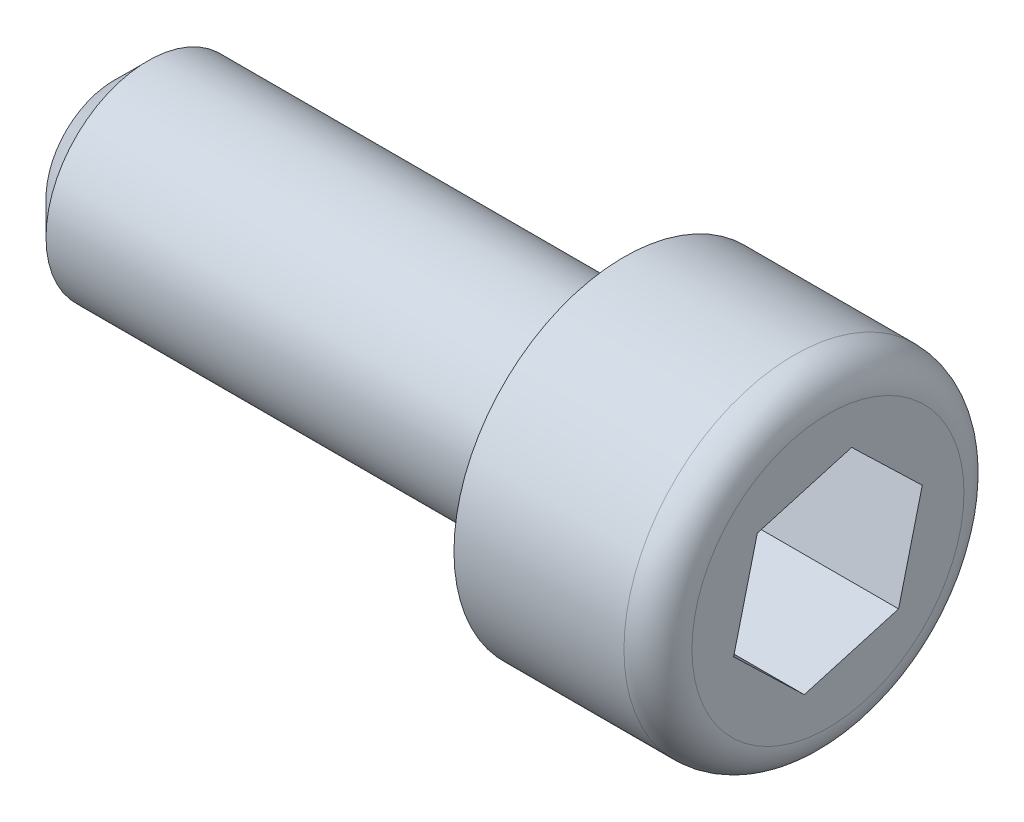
ISO-10303-21;
HEADER;
FILE_DESCRIPTION(('STEP AP214'),'2;1');
FILE_NAME('part.step','',(''),(''),'','','');
FILE_SCHEMA(('AUTOMOTIVE_DESIGN { 1 0 10303 214 1 1 1 1 }'));
ENDSEC;
DATA;
#1=APPLICATION_CONTEXT('core data for automotive mechanical design processes');
#2=APPLICATION_PROTOCOL_DEFINITION('international standard','automotive_design',2000,#1);
#3=PRODUCT_CONTEXT('',#1,'mechanical');
#4=PRODUCT('Part','Part','',(#3));
#5=PRODUCT_RELATED_PRODUCT_CATEGORY('part','',(#4));
#6=PRODUCT_DEFINITION_FORMATION('','',#4);
#7=PRODUCT_DEFINITION_CONTEXT('part definition',#1,'design');
#8=PRODUCT_DEFINITION('design','',#6,#7);
#9=PRODUCT_DEFINITION_SHAPE('','',#8);
#10=(LENGTH_UNIT() NAMED_UNIT(*) SI_UNIT(.MILLI.,.METRE.));
#11=(NAMED_UNIT(*) PLANE_ANGLE_UNIT() SI_UNIT($,.RADIAN.));
#12=(NAMED_UNIT(*) SI_UNIT($,.STERADIAN.) SOLID_ANGLE_UNIT());
#13=UNCERTAINTY_MEASURE_WITH_UNIT(LENGTH_MEASURE(1.E-05),#10,'distance_accuracy_value','');
#14=(GEOMETRIC_REPRESENTATION_CONTEXT(3) GLOBAL_UNCERTAINTY_ASSIGNED_CONTEXT((#13)) GLOBAL_UNIT_ASSIGNED_CONTEXT((#10,
#11,#12)) REPRESENTATION_CONTEXT('',''));
#15=CARTESIAN_POINT('',(0.,0.,0.));
#16=DIRECTION('',(0.,0.,1.));
#17=DIRECTION('',(1.,0.,0.));
#18=AXIS2_PLACEMENT_3D('',#15,#16,#17);
#19=CARTESIAN_POINT('',(0.,0.,0.));
#20=DIRECTION('',(-1.,0.,0.));
#21=DIRECTION('',(0.,0.,1.));
#22=AXIS2_PLACEMENT_3D('',#19,#20,#21);
#23=PLANE('',#22);
#24=DIRECTION('',(0.,0.970474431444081,-0.241204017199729));
#25=VECTOR('',#24,1.);
#26=CARTESIAN_POINT('',(0.,-2.00376922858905,-2.0780380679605));
#27=LINE('',#26,#25);
#28=CARTESIAN_POINT('',(0.,-2.00376922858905,-2.0780380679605));
#29=VERTEX_POINT('',#28);
#30=CARTESIAN_POINT('',(0.,0.797749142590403,-2.77433408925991));
#31=VERTEX_POINT('',#30);
#32=EDGE_CURVE('E97',#29,#31,#27,.T.);
#33=ORIENTED_EDGE('',*,*,#32,.F.);
#34=DIRECTION('',(0.,0.276348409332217,-0.961057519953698));
#35=VECTOR('',#34,1.);
#36=CARTESIAN_POINT('',(0.,-2.80151837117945,0.696296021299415));
#37=LINE('',#36,#35);
#38=CARTESIAN_POINT('',(0.,-2.80151837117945,0.696296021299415));
#39=VERTEX_POINT('',#38);
#40=EDGE_CURVE('E43',#39,#29,#37,.T.);
#41=ORIENTED_EDGE('',*,*,#40,.F.);
#42=DIRECTION('',(0.,-0.694126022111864,-0.71985350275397));
#43=VECTOR('',#42,1.);
#44=CARTESIAN_POINT('',(0.,-0.797749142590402,2.77433408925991));
#45=LINE('',#44,#43);
#46=CARTESIAN_POINT('',(0.,-0.797749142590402,2.77433408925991));
#47=VERTEX_POINT('',#46);
#48=EDGE_CURVE('E112',#47,#39,#45,.T.);
#49=ORIENTED_EDGE('',*,*,#48,.F.);
#50=DIRECTION('',(0.,-0.970474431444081,0.241204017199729));
#51=VECTOR('',#50,1.);
#52=CARTESIAN_POINT('',(0.,2.00376922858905,2.0780380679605));
#53=LINE('',#52,#51);
#54=CARTESIAN_POINT('',(0.,2.00376922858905,2.0780380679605));
#55=VERTEX_POINT('',#54);
#56=EDGE_CURVE('E106',#55,#47,#53,.T.);
#57=ORIENTED_EDGE('',*,*,#56,.F.);
#58=DIRECTION('',(0.,-0.276348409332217,0.961057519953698));
#59=VECTOR('',#58,1.);
#60=CARTESIAN_POINT('',(0.,2.80151837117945,-0.696296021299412));
#61=LINE('',#60,#59);
#62=CARTESIAN_POINT('',(0.,2.80151837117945,-0.696296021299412));
#63=VERTEX_POINT('',#62);
#64=EDGE_CURVE('E104',#63,#55,#61,.T.);
#65=ORIENTED_EDGE('',*,*,#64,.F.);
#66=DIRECTION('',(0.,0.694126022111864,0.71985350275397));
#67=VECTOR('',#66,1.);
#68=CARTESIAN_POINT('',(0.,0.797749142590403,-2.77433408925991));
#69=LINE('',#68,#67);
#70=EDGE_CURVE('E86',#31,#63,#69,.T.);
#71=ORIENTED_EDGE('',*,*,#70,.F.);
#72=EDGE_LOOP('',(#33,#41,#49,#57,#65,#71));
#73=FACE_BOUND('',#72,.T.);
#74=CARTESIAN_POINT('',(0.,0.,0.));
#75=DIRECTION('',(-1.,0.,0.));
#76=DIRECTION('',(0.,0.,1.));
#77=AXIS2_PLACEMENT_3D('',#74,#75,#76);
#78=CIRCLE('',#77,4.);
#79=CARTESIAN_POINT('',(0.,0.,4.));
#80=VERTEX_POINT('',#79);
#81=EDGE_CURVE('E11',#80,#80,#78,.F.);
#82=ORIENTED_EDGE('',*,*,#81,.T.);
#83=EDGE_LOOP('',(#82));
#84=FACE_BOUND('',#83,.T.);
#85=ADVANCED_FACE('F29',(#73,#84),#23,.F.);
#86=CARTESIAN_POINT('',(-41.,0.,0.));
#87=DIRECTION('',(-1.,0.,0.));
#88=DIRECTION('',(0.,0.,1.));
#89=AXIS2_PLACEMENT_3D('',#86,#87,#88);
#90=CYLINDRICAL_SURFACE('',#89,5.);
#91=CARTESIAN_POINT('',(-1.,0.,0.));
#92=DIRECTION('',(-1.,0.,0.));
#93=DIRECTION('',(0.,0.,1.));
#94=AXIS2_PLACEMENT_3D('',#91,#92,#93);
#95=CIRCLE('',#94,5.);
#96=CARTESIAN_POINT('',(-1.,0.,5.));
#97=VERTEX_POINT('',#96);
#98=EDGE_CURVE('E36',#97,#97,#95,.T.);
#99=ORIENTED_EDGE('',*,*,#98,.T.);
#100=EDGE_LOOP('',(#99));
#101=FACE_BOUND('',#100,.T.);
#102=CARTESIAN_POINT('',(-6.,0.,0.));
#103=DIRECTION('',(-1.,0.,0.));
#104=DIRECTION('',(0.,0.,1.));
#105=AXIS2_PLACEMENT_3D('',#102,#103,#104);
#106=CIRCLE('',#105,5.);
#107=CARTESIAN_POINT('',(-6.,0.,5.));
#108=VERTEX_POINT('',#107);
#109=EDGE_CURVE('E139',#108,#108,#106,.T.);
#110=ORIENTED_EDGE('',*,*,#109,.F.);
#111=EDGE_LOOP('',(#110));
#112=FACE_BOUND('',#111,.T.);
#113=ADVANCED_FACE('F150',(#101,#112),#90,.T.);
#114=CARTESIAN_POINT('',(-6.,5.,0.));
#115=DIRECTION('',(1.,0.,0.));
#116=DIRECTION('',(0.,0.,-1.));
#117=AXIS2_PLACEMENT_3D('',#114,#115,#116);
#118=PLANE('',#117);
#119=CARTESIAN_POINT('',(-6.,0.,0.));
#120=DIRECTION('',(-1.,0.,0.));
#121=DIRECTION('',(0.,0.,1.));
#122=AXIS2_PLACEMENT_3D('',#119,#120,#121);
#123=CIRCLE('',#122,3.);
#124=CARTESIAN_POINT('',(-6.,0.,3.));
#125=VERTEX_POINT('',#124);
#126=EDGE_CURVE('E130',#125,#125,#123,.T.);
#127=ORIENTED_EDGE('',*,*,#126,.F.);
#128=EDGE_LOOP('',(#127));
#129=FACE_BOUND('',#128,.T.);
#130=ORIENTED_EDGE('',*,*,#109,.T.);
#131=EDGE_LOOP('',(#130));
#132=FACE_BOUND('',#131,.T.);
#133=ADVANCED_FACE('F173',(#129,#132),#118,.F.);
#134=CARTESIAN_POINT('',(-41.,0.,0.));
#135=DIRECTION('',(-1.,0.,0.));
#136=DIRECTION('',(0.,0.,1.));
#137=AXIS2_PLACEMENT_3D('',#134,#135,#136);
#138=CYLINDRICAL_SURFACE('',#137,3.);
#139=CARTESIAN_POINT('',(-20.,0.,0.));
#140=DIRECTION('',(1.,0.,0.));
#141=DIRECTION('',(0.,0.,-1.));
#142=AXIS2_PLACEMENT_3D('',#139,#140,#141);
#143=CIRCLE('',#142,3.);
#144=CARTESIAN_POINT('',(-20.,0.,-3.));
#145=VERTEX_POINT('',#144);
#146=EDGE_CURVE('E145',#145,#145,#143,.T.);
#147=ORIENTED_EDGE('',*,*,#146,.T.);
#148=EDGE_LOOP('',(#147));
#149=FACE_BOUND('',#148,.T.);
#150=ORIENTED_EDGE('',*,*,#126,.T.);
#151=EDGE_LOOP('',(#150));
#152=FACE_BOUND('',#151,.T.);
#153=ADVANCED_FACE('F177',(#149,#152),#138,.T.);
#154=CARTESIAN_POINT('',(-21.,3.,0.));
#155=DIRECTION('',(1.,0.,0.));
#156=DIRECTION('',(0.,0.,-1.));
#157=AXIS2_PLACEMENT_3D('',#154,#155,#156);
#158=PLANE('',#157);
#159=CARTESIAN_POINT('',(-21.,0.,0.));
#160=DIRECTION('',(1.,0.,0.));
#161=DIRECTION('',(0.,0.,-1.));
#162=AXIS2_PLACEMENT_3D('',#159,#160,#161);
#163=CIRCLE('',#162,1.99999999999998);
#164=CARTESIAN_POINT('',(-21.,0.,-1.99999999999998));
#165=VERTEX_POINT('',#164);
#166=EDGE_CURVE('E142',#165,#165,#163,.F.);
#167=ORIENTED_EDGE('',*,*,#166,.T.);
#168=EDGE_LOOP('',(#167));
#169=FACE_BOUND('',#168,.T.);
#170=ADVANCED_FACE('F165',(#169),#158,.F.);
#171=CARTESIAN_POINT('',(-21.,0.,0.));
#172=DIRECTION('',(1.,0.,0.));
#173=DIRECTION('',(0.,0.,-1.));
#174=AXIS2_PLACEMENT_3D('',#171,#172,#173);
#175=CONICAL_SURFACE('',#174,1.99999999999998,0.785398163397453);
#176=ORIENTED_EDGE('',*,*,#146,.F.);
#177=EDGE_LOOP('',(#176));
#178=FACE_BOUND('',#177,.T.);
#179=ORIENTED_EDGE('',*,*,#166,.F.);
#180=EDGE_LOOP('',(#179));
#181=FACE_BOUND('',#180,.T.);
#182=ADVANCED_FACE('F156',(#178,#181),#175,.T.);
#183=CARTESIAN_POINT('',(-1.,0.,0.));
#184=DIRECTION('',(-1.,0.,0.));
#185=DIRECTION('',(0.,0.,1.));
#186=AXIS2_PLACEMENT_3D('',#183,#184,#185);
#187=TOROIDAL_SURFACE('',#186,4.,1.);
#188=ORIENTED_EDGE('',*,*,#81,.F.);
#189=EDGE_LOOP('',(#188));
#190=FACE_BOUND('',#189,.T.);
#191=ORIENTED_EDGE('',*,*,#98,.F.);
#192=EDGE_LOOP('',(#191));
#193=FACE_BOUND('',#192,.T.);
#194=ADVANCED_FACE('F153',(#190,#193),#187,.T.);
#195=CARTESIAN_POINT('',(-5.,-2.80151837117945,0.696296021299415));
#196=DIRECTION('',(0.,-0.961057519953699,-0.276348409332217));
#197=DIRECTION('',(0.,0.276348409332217,-0.961057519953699));
#198=AXIS2_PLACEMENT_3D('',#195,#196,#197);
#199=PLANE('',#198);
#200=ORIENTED_EDGE('',*,*,#40,.T.);
#201=DIRECTION('',(1.,0.,0.));
#202=VECTOR('',#201,1.);
#203=CARTESIAN_POINT('',(-5.,-2.00376922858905,-2.0780380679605));
#204=LINE('',#203,#202);
#205=CARTESIAN_POINT('',(-5.,-2.00376922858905,-2.0780380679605));
#206=VERTEX_POINT('',#205);
#207=EDGE_CURVE('E94',#206,#29,#204,.T.);
#208=ORIENTED_EDGE('',*,*,#207,.F.);
#209=DIRECTION('',(0.,0.276348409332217,-0.961057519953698));
#210=VECTOR('',#209,1.);
#211=CARTESIAN_POINT('',(-5.,-2.80151837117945,0.696296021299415));
#212=LINE('',#211,#210);
#213=CARTESIAN_POINT('',(-5.,-2.80151837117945,0.696296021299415));
#214=VERTEX_POINT('',#213);
#215=EDGE_CURVE('E114',#214,#206,#212,.T.);
#216=ORIENTED_EDGE('',*,*,#215,.F.);
#217=DIRECTION('',(1.,0.,0.));
#218=VECTOR('',#217,1.);
#219=CARTESIAN_POINT('',(-5.,-2.80151837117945,0.696296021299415));
#220=LINE('',#219,#218);
#221=EDGE_CURVE('E50',#214,#39,#220,.T.);
#222=ORIENTED_EDGE('',*,*,#221,.T.);
#223=EDGE_LOOP('',(#200,#208,#216,#222));
#224=FACE_BOUND('',#223,.T.);
#225=ADVANCED_FACE('F155',(#224),#199,.F.);
#226=CARTESIAN_POINT('',(-5.,-0.797749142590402,2.77433408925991));
#227=DIRECTION('',(0.,-0.71985350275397,0.694126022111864));
#228=DIRECTION('',(0.,-0.694126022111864,-0.71985350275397));
#229=AXIS2_PLACEMENT_3D('',#226,#227,#228);
#230=PLANE('',#229);
#231=ORIENTED_EDGE('',*,*,#48,.T.);
#232=ORIENTED_EDGE('',*,*,#221,.F.);
#233=DIRECTION('',(0.,-0.694126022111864,-0.71985350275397));
#234=VECTOR('',#233,1.);
#235=CARTESIAN_POINT('',(-5.,-0.797749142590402,2.77433408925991));
#236=LINE('',#235,#234);
#237=CARTESIAN_POINT('',(-5.,-0.797749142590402,2.77433408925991));
#238=VERTEX_POINT('',#237);
#239=EDGE_CURVE('E126',#238,#214,#236,.T.);
#240=ORIENTED_EDGE('',*,*,#239,.F.);
#241=DIRECTION('',(1.,0.,0.));
#242=VECTOR('',#241,1.);
#243=CARTESIAN_POINT('',(-5.,-0.797749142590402,2.77433408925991));
#244=LINE('',#243,#242);
#245=EDGE_CURVE('E131',#238,#47,#244,.T.);
#246=ORIENTED_EDGE('',*,*,#245,.T.);
#247=EDGE_LOOP('',(#231,#232,#240,#246));
#248=FACE_BOUND('',#247,.T.);
#249=ADVANCED_FACE('F163',(#248),#230,.F.);
#250=CARTESIAN_POINT('',(-5.,2.00376922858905,2.0780380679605));
#251=DIRECTION('',(0.,0.241204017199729,0.970474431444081));
#252=DIRECTION('',(0.,-0.970474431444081,0.241204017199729));
#253=AXIS2_PLACEMENT_3D('',#250,#251,#252);
#254=PLANE('',#253);
#255=ORIENTED_EDGE('',*,*,#56,.T.);
#256=ORIENTED_EDGE('',*,*,#245,.F.);
#257=DIRECTION('',(0.,-0.970474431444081,0.241204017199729));
#258=VECTOR('',#257,1.);
#259=CARTESIAN_POINT('',(-5.,2.00376922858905,2.0780380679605));
#260=LINE('',#259,#258);
#261=CARTESIAN_POINT('',(-5.,2.00376922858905,2.0780380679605));
#262=VERTEX_POINT('',#261);
#263=EDGE_CURVE('E123',#262,#238,#260,.T.);
#264=ORIENTED_EDGE('',*,*,#263,.F.);
#265=DIRECTION('',(1.,0.,0.));
#266=VECTOR('',#265,1.);
#267=CARTESIAN_POINT('',(-5.,2.00376922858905,2.0780380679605));
#268=LINE('',#267,#266);
#269=EDGE_CURVE('E133',#262,#55,#268,.T.);
#270=ORIENTED_EDGE('',*,*,#269,.T.);
#271=EDGE_LOOP('',(#255,#256,#264,#270));
#272=FACE_BOUND('',#271,.T.);
#273=ADVANCED_FACE('F215',(#272),#254,.F.);
#274=CARTESIAN_POINT('',(-5.,2.80151837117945,-0.696296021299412));
#275=DIRECTION('',(0.,0.961057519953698,0.276348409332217));
#276=DIRECTION('',(0.,-0.276348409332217,0.961057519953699));
#277=AXIS2_PLACEMENT_3D('',#274,#275,#276);
#278=PLANE('',#277);
#279=ORIENTED_EDGE('',*,*,#64,.T.);
#280=ORIENTED_EDGE('',*,*,#269,.F.);
#281=DIRECTION('',(0.,-0.276348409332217,0.961057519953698));
#282=VECTOR('',#281,1.);
#283=CARTESIAN_POINT('',(-5.,2.80151837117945,-0.696296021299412));
#284=LINE('',#283,#282);
#285=CARTESIAN_POINT('',(-5.,2.80151837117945,-0.696296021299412));
#286=VERTEX_POINT('',#285);
#287=EDGE_CURVE('E120',#286,#262,#284,.T.);
#288=ORIENTED_EDGE('',*,*,#287,.F.);
#289=DIRECTION('',(1.,0.,0.));
#290=VECTOR('',#289,1.);
#291=CARTESIAN_POINT('',(-5.,2.80151837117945,-0.696296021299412));
#292=LINE('',#291,#290);
#293=EDGE_CURVE('E93',#286,#63,#292,.T.);
#294=ORIENTED_EDGE('',*,*,#293,.T.);
#295=EDGE_LOOP('',(#279,#280,#288,#294));
#296=FACE_BOUND('',#295,.T.);
#297=ADVANCED_FACE('F224',(#296),#278,.F.);
#298=CARTESIAN_POINT('',(-5.,0.797749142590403,-2.77433408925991));
#299=DIRECTION('',(0.,0.71985350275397,-0.694126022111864));
#300=DIRECTION('',(0.,0.694126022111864,0.71985350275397));
#301=AXIS2_PLACEMENT_3D('',#298,#299,#300);
#302=PLANE('',#301);
#303=ORIENTED_EDGE('',*,*,#70,.T.);
#304=ORIENTED_EDGE('',*,*,#293,.F.);
#305=DIRECTION('',(0.,0.694126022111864,0.71985350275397));
#306=VECTOR('',#305,1.);
#307=CARTESIAN_POINT('',(-5.,0.797749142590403,-2.77433408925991));
#308=LINE('',#307,#306);
#309=CARTESIAN_POINT('',(-5.,0.797749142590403,-2.77433408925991));
#310=VERTEX_POINT('',#309);
#311=EDGE_CURVE('E89',#310,#286,#308,.T.);
#312=ORIENTED_EDGE('',*,*,#311,.F.);
#313=DIRECTION('',(1.,0.,0.));
#314=VECTOR('',#313,1.);
#315=CARTESIAN_POINT('',(-5.,0.797749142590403,-2.77433408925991));
#316=LINE('',#315,#314);
#317=EDGE_CURVE('E82',#310,#31,#316,.T.);
#318=ORIENTED_EDGE('',*,*,#317,.T.);
#319=EDGE_LOOP('',(#303,#304,#312,#318));
#320=FACE_BOUND('',#319,.T.);
#321=ADVANCED_FACE('F84',(#320),#302,.F.);
#322=CARTESIAN_POINT('',(-5.,-2.00376922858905,-2.0780380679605));
#323=DIRECTION('',(0.,-0.241204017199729,-0.970474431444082));
#324=DIRECTION('',(0.,0.970474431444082,-0.241204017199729));
#325=AXIS2_PLACEMENT_3D('',#322,#323,#324);
#326=PLANE('',#325);
#327=ORIENTED_EDGE('',*,*,#32,.T.);
#328=ORIENTED_EDGE('',*,*,#317,.F.);
#329=DIRECTION('',(0.,0.970474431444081,-0.241204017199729));
#330=VECTOR('',#329,1.);
#331=CARTESIAN_POINT('',(-5.,-2.00376922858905,-2.0780380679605));
#332=LINE('',#331,#330);
#333=EDGE_CURVE('E117',#206,#310,#332,.T.);
#334=ORIENTED_EDGE('',*,*,#333,.F.);
#335=ORIENTED_EDGE('',*,*,#207,.T.);
#336=EDGE_LOOP('',(#327,#328,#334,#335));
#337=FACE_BOUND('',#336,.T.);
#338=ADVANCED_FACE('F98',(#337),#326,.F.);
#339=CARTESIAN_POINT('',(-5.,-1.20602008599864,-4.85237215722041));
#340=DIRECTION('',(1.,0.,0.));
#341=DIRECTION('',(0.,0.,-1.));
#342=AXIS2_PLACEMENT_3D('',#339,#340,#341);
#343=PLANE('',#342);
#344=ORIENTED_EDGE('',*,*,#215,.T.);
#345=ORIENTED_EDGE('',*,*,#333,.T.);
#346=ORIENTED_EDGE('',*,*,#311,.T.);
#347=ORIENTED_EDGE('',*,*,#287,.T.);
#348=ORIENTED_EDGE('',*,*,#263,.T.);
#349=ORIENTED_EDGE('',*,*,#239,.T.);
#350=EDGE_LOOP('',(#344,#345,#346,#347,#348,#349));
#351=FACE_BOUND('',#350,.T.);
#352=ADVANCED_FACE('F251',(#351),#343,.T.);
#353=CLOSED_SHELL('',(#85,#113,#133,#153,#170,#182,#194,#225,#249,#273,#297,#321,#338,#352));
#354=MANIFOLD_SOLID_BREP('B2',#353);
#355=ADVANCED_BREP_SHAPE_REPRESENTATION('',(#18,#354),#14);
#356=SHAPE_DEFINITION_REPRESENTATION(#9,#355);
ENDSEC;
END-ISO-10303-21;
